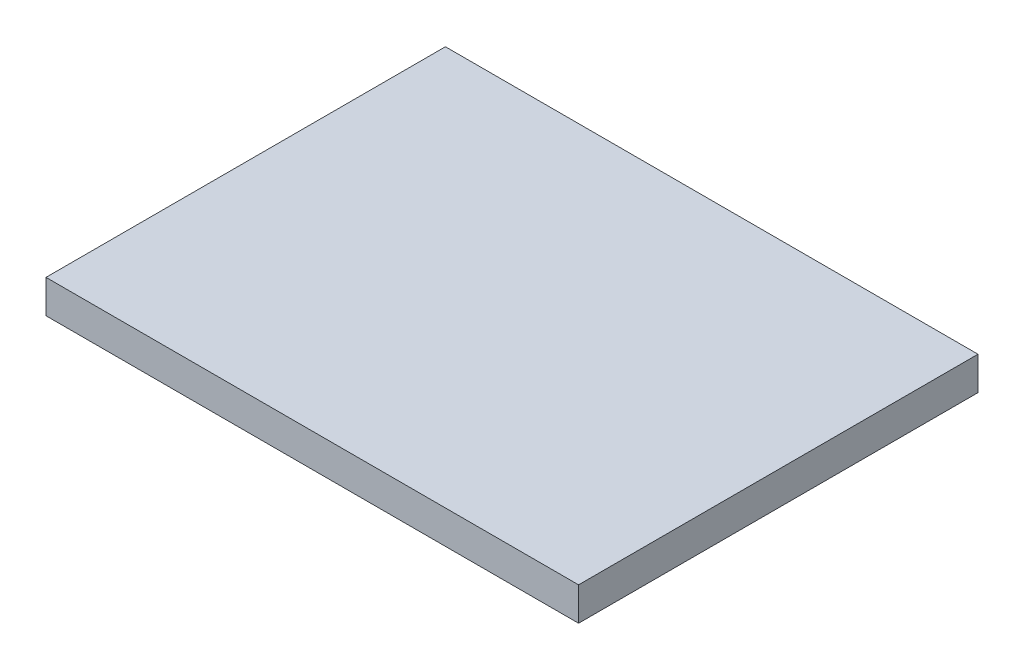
from build123d import *

# Parameters (mm, degrees)
SKETCH1_W           = 304.8
SKETCH1_H           = 228.6
BOSS_EXTRUDE1_DEPTH = 19.05


with BuildPart() as part:
    # Sketch1 → Boss-Extrude1 (new body)
    with BuildSketch(Plane(origin=(0, 0, 0), x_dir=(1, 0, 0), z_dir=(0, 1, 0))):
        with Locations((0, 38.1)):
            Rectangle(SKETCH1_W, SKETCH1_H)
    extrude(amount=BOSS_EXTRUDE1_DEPTH)


solid = part.part
